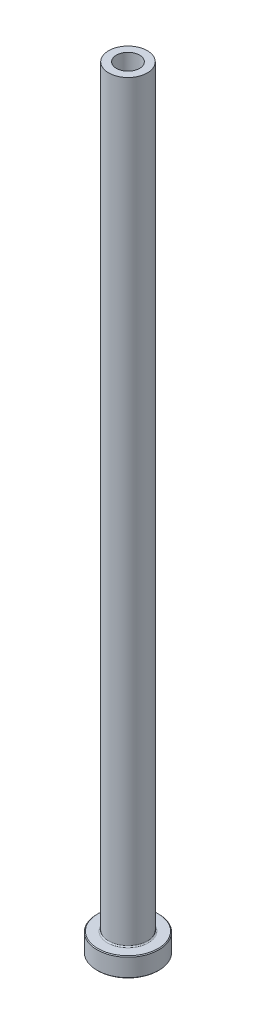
ISO-10303-21;
HEADER;
FILE_DESCRIPTION(('STEP AP214'),'2;1');
FILE_NAME('part.step','',(''),(''),'','','');
FILE_SCHEMA(('AUTOMOTIVE_DESIGN { 1 0 10303 214 1 1 1 1 }'));
ENDSEC;
DATA;
#1=APPLICATION_CONTEXT('core data for automotive mechanical design processes');
#2=APPLICATION_PROTOCOL_DEFINITION('international standard','automotive_design',2000,#1);
#3=PRODUCT_CONTEXT('',#1,'mechanical');
#4=PRODUCT('Part','Part','',(#3));
#5=PRODUCT_RELATED_PRODUCT_CATEGORY('part','',(#4));
#6=PRODUCT_DEFINITION_FORMATION('','',#4);
#7=PRODUCT_DEFINITION_CONTEXT('part definition',#1,'design');
#8=PRODUCT_DEFINITION('design','',#6,#7);
#9=PRODUCT_DEFINITION_SHAPE('','',#8);
#10=(LENGTH_UNIT() NAMED_UNIT(*) SI_UNIT(.MILLI.,.METRE.));
#11=(NAMED_UNIT(*) PLANE_ANGLE_UNIT() SI_UNIT($,.RADIAN.));
#12=(NAMED_UNIT(*) SI_UNIT($,.STERADIAN.) SOLID_ANGLE_UNIT());
#13=UNCERTAINTY_MEASURE_WITH_UNIT(LENGTH_MEASURE(1.E-05),#10,'distance_accuracy_value','');
#14=(GEOMETRIC_REPRESENTATION_CONTEXT(3) GLOBAL_UNCERTAINTY_ASSIGNED_CONTEXT((#13)) GLOBAL_UNIT_ASSIGNED_CONTEXT((#10,
#11,#12)) REPRESENTATION_CONTEXT('',''));
#15=CARTESIAN_POINT('',(0.,0.,0.));
#16=DIRECTION('',(0.,0.,1.));
#17=DIRECTION('',(1.,0.,0.));
#18=AXIS2_PLACEMENT_3D('',#15,#16,#17);
#19=CARTESIAN_POINT('',(0.,92.1876809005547,0.));
#20=DIRECTION('',(0.,1.,0.));
#21=DIRECTION('',(0.,0.,1.));
#22=AXIS2_PLACEMENT_3D('',#19,#20,#21);
#23=CYLINDRICAL_SURFACE('',#22,3.);
#24=CARTESIAN_POINT('',(0.,200.,0.));
#25=DIRECTION('',(0.,1.,0.));
#26=DIRECTION('',(0.,0.,1.));
#27=AXIS2_PLACEMENT_3D('',#24,#25,#26);
#28=CIRCLE('',#27,3.);
#29=CARTESIAN_POINT('',(0.,200.,3.));
#30=VERTEX_POINT('',#29);
#31=EDGE_CURVE('E62',#30,#30,#28,.T.);
#32=ORIENTED_EDGE('',*,*,#31,.T.);
#33=EDGE_LOOP('',(#32));
#34=FACE_BOUND('',#33,.T.);
#35=CARTESIAN_POINT('',(0.,155.,0.));
#36=DIRECTION('',(0.,1.,0.));
#37=DIRECTION('',(0.,0.,1.));
#38=AXIS2_PLACEMENT_3D('',#35,#36,#37);
#39=CIRCLE('',#38,3.);
#40=CARTESIAN_POINT('',(0.,155.,3.));
#41=VERTEX_POINT('',#40);
#42=EDGE_CURVE('E71',#41,#41,#39,.T.);
#43=ORIENTED_EDGE('',*,*,#42,.F.);
#44=EDGE_LOOP('',(#43));
#45=FACE_BOUND('',#44,.T.);
#46=ADVANCED_FACE('F30',(#34,#45),#23,.F.);
#47=CARTESIAN_POINT('',(-3.,200.,0.));
#48=DIRECTION('',(0.,1.,0.));
#49=DIRECTION('',(0.,0.,1.));
#50=AXIS2_PLACEMENT_3D('',#47,#48,#49);
#51=PLANE('',#50);
#52=CARTESIAN_POINT('',(0.,200.,0.));
#53=DIRECTION('',(0.,1.,0.));
#54=DIRECTION('',(0.,0.,1.));
#55=AXIS2_PLACEMENT_3D('',#52,#53,#54);
#56=CIRCLE('',#55,5.00000000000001);
#57=CARTESIAN_POINT('',(0.,200.,5.00000000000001));
#58=VERTEX_POINT('',#57);
#59=EDGE_CURVE('E65',#58,#58,#56,.T.);
#60=ORIENTED_EDGE('',*,*,#59,.T.);
#61=EDGE_LOOP('',(#60));
#62=FACE_BOUND('',#61,.T.);
#63=ORIENTED_EDGE('',*,*,#31,.F.);
#64=EDGE_LOOP('',(#63));
#65=FACE_BOUND('',#64,.T.);
#66=ADVANCED_FACE('F79',(#62,#65),#51,.T.);
#67=CARTESIAN_POINT('',(0.,92.1876809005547,0.));
#68=DIRECTION('',(0.,1.,0.));
#69=DIRECTION('',(0.,0.,1.));
#70=AXIS2_PLACEMENT_3D('',#67,#68,#69);
#71=CYLINDRICAL_SURFACE('',#70,5.);
#72=CARTESIAN_POINT('',(0.,5.3,0.));
#73=DIRECTION('',(0.,1.,0.));
#74=DIRECTION('',(0.,0.,1.));
#75=AXIS2_PLACEMENT_3D('',#72,#73,#74);
#76=CIRCLE('',#75,5.);
#77=CARTESIAN_POINT('',(0.,5.3,5.));
#78=VERTEX_POINT('',#77);
#79=EDGE_CURVE('E59',#78,#78,#76,.T.);
#80=ORIENTED_EDGE('',*,*,#79,.T.);
#81=EDGE_LOOP('',(#80));
#82=FACE_BOUND('',#81,.T.);
#83=ORIENTED_EDGE('',*,*,#59,.F.);
#84=EDGE_LOOP('',(#83));
#85=FACE_BOUND('',#84,.T.);
#86=ADVANCED_FACE('F85',(#82,#85),#71,.T.);
#87=CARTESIAN_POINT('',(-4.99999999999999,5.,0.));
#88=DIRECTION('',(0.,1.,0.));
#89=DIRECTION('',(0.,0.,1.));
#90=AXIS2_PLACEMENT_3D('',#87,#88,#89);
#91=PLANE('',#90);
#92=CARTESIAN_POINT('',(0.,5.,0.));
#93=DIRECTION('',(0.,1.,0.));
#94=DIRECTION('',(0.,0.,1.));
#95=AXIS2_PLACEMENT_3D('',#92,#93,#94);
#96=CIRCLE('',#95,7.79999999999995);
#97=CARTESIAN_POINT('',(0.,5.,7.79999999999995));
#98=VERTEX_POINT('',#97);
#99=EDGE_CURVE('E53',#98,#98,#96,.T.);
#100=ORIENTED_EDGE('',*,*,#99,.T.);
#101=EDGE_LOOP('',(#100));
#102=FACE_BOUND('',#101,.T.);
#103=CARTESIAN_POINT('',(0.,5.,0.));
#104=DIRECTION('',(0.,1.,0.));
#105=DIRECTION('',(0.,0.,1.));
#106=AXIS2_PLACEMENT_3D('',#103,#104,#105);
#107=CIRCLE('',#106,5.3);
#108=CARTESIAN_POINT('',(0.,5.,5.3));
#109=VERTEX_POINT('',#108);
#110=EDGE_CURVE('E56',#109,#109,#107,.F.);
#111=ORIENTED_EDGE('',*,*,#110,.T.);
#112=EDGE_LOOP('',(#111));
#113=FACE_BOUND('',#112,.T.);
#114=ADVANCED_FACE('F111',(#102,#113),#91,.T.);
#115=CARTESIAN_POINT('',(0.,92.1876809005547,0.));
#116=DIRECTION('',(0.,1.,0.));
#117=DIRECTION('',(0.,0.,1.));
#118=AXIS2_PLACEMENT_3D('',#115,#116,#117);
#119=CYLINDRICAL_SURFACE('',#118,7.99999999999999);
#120=CARTESIAN_POINT('',(0.,4.79999999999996,0.));
#121=DIRECTION('',(0.,1.,0.));
#122=DIRECTION('',(0.,0.,1.));
#123=AXIS2_PLACEMENT_3D('',#120,#121,#122);
#124=CIRCLE('',#123,7.99999999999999);
#125=CARTESIAN_POINT('',(0.,4.79999999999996,7.99999999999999));
#126=VERTEX_POINT('',#125);
#127=EDGE_CURVE('E45',#126,#126,#124,.F.);
#128=ORIENTED_EDGE('',*,*,#127,.T.);
#129=EDGE_LOOP('',(#128));
#130=FACE_BOUND('',#129,.T.);
#131=CARTESIAN_POINT('',(0.,0.200000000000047,0.));
#132=DIRECTION('',(0.,-1.,0.));
#133=DIRECTION('',(0.,0.,-1.));
#134=AXIS2_PLACEMENT_3D('',#131,#132,#133);
#135=CIRCLE('',#134,7.99999999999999);
#136=CARTESIAN_POINT('',(0.,0.200000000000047,-7.99999999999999));
#137=VERTEX_POINT('',#136);
#138=EDGE_CURVE('E50',#137,#137,#135,.F.);
#139=ORIENTED_EDGE('',*,*,#138,.T.);
#140=EDGE_LOOP('',(#139));
#141=FACE_BOUND('',#140,.T.);
#142=ADVANCED_FACE('F108',(#130,#141),#119,.T.);
#143=CARTESIAN_POINT('',(-7.99999999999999,0.,0.));
#144=DIRECTION('',(0.,-1.,0.));
#145=DIRECTION('',(0.,0.,-1.));
#146=AXIS2_PLACEMENT_3D('',#143,#144,#145);
#147=PLANE('',#146);
#148=CARTESIAN_POINT('',(0.,0.,0.));
#149=DIRECTION('',(0.,-1.,0.));
#150=DIRECTION('',(0.,0.,-1.));
#151=AXIS2_PLACEMENT_3D('',#148,#149,#150);
#152=CIRCLE('',#151,3.74999999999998);
#153=CARTESIAN_POINT('',(0.,0.,-3.74999999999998));
#154=VERTEX_POINT('',#153);
#155=EDGE_CURVE('E37',#154,#154,#152,.F.);
#156=ORIENTED_EDGE('',*,*,#155,.T.);
#157=EDGE_LOOP('',(#156));
#158=FACE_BOUND('',#157,.T.);
#159=CARTESIAN_POINT('',(0.,0.,0.));
#160=DIRECTION('',(0.,-1.,0.));
#161=DIRECTION('',(0.,0.,-1.));
#162=AXIS2_PLACEMENT_3D('',#159,#160,#161);
#163=CIRCLE('',#162,7.79999999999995);
#164=CARTESIAN_POINT('',(0.,0.,-7.79999999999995));
#165=VERTEX_POINT('',#164);
#166=EDGE_CURVE('E41',#165,#165,#163,.T.);
#167=ORIENTED_EDGE('',*,*,#166,.T.);
#168=EDGE_LOOP('',(#167));
#169=FACE_BOUND('',#168,.T.);
#170=ADVANCED_FACE('F110',(#158,#169),#147,.T.);
#171=CARTESIAN_POINT('',(0.,92.1876809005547,0.));
#172=DIRECTION('',(0.,1.,0.));
#173=DIRECTION('',(0.,0.,1.));
#174=AXIS2_PLACEMENT_3D('',#171,#172,#173);
#175=CYLINDRICAL_SURFACE('',#174,3.25);
#176=CARTESIAN_POINT('',(0.,0.499999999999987,0.));
#177=DIRECTION('',(0.,-1.,0.));
#178=DIRECTION('',(0.,0.,-1.));
#179=AXIS2_PLACEMENT_3D('',#176,#177,#178);
#180=CIRCLE('',#179,3.25);
#181=CARTESIAN_POINT('',(0.,0.499999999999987,-3.25));
#182=VERTEX_POINT('',#181);
#183=EDGE_CURVE('E10',#182,#182,#180,.T.);
#184=ORIENTED_EDGE('',*,*,#183,.T.);
#185=EDGE_LOOP('',(#184));
#186=FACE_BOUND('',#185,.T.);
#187=CARTESIAN_POINT('',(0.,143.,0.));
#188=DIRECTION('',(0.,1.,0.));
#189=DIRECTION('',(0.,0.,1.));
#190=AXIS2_PLACEMENT_3D('',#187,#188,#189);
#191=CIRCLE('',#190,3.25000000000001);
#192=CARTESIAN_POINT('',(0.,143.,3.25000000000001));
#193=VERTEX_POINT('',#192);
#194=EDGE_CURVE('E68',#193,#193,#191,.T.);
#195=ORIENTED_EDGE('',*,*,#194,.T.);
#196=EDGE_LOOP('',(#195));
#197=FACE_BOUND('',#196,.T.);
#198=ADVANCED_FACE('F118',(#186,#197),#175,.F.);
#199=CARTESIAN_POINT('',(0.,143.,0.));
#200=DIRECTION('',(0.,-1.,0.));
#201=DIRECTION('',(0.,0.,-1.));
#202=AXIS2_PLACEMENT_3D('',#199,#200,#201);
#203=CONICAL_SURFACE('',#202,3.25000000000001,0.0208303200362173);
#204=ORIENTED_EDGE('',*,*,#42,.T.);
#205=EDGE_LOOP('',(#204));
#206=FACE_BOUND('',#205,.T.);
#207=ORIENTED_EDGE('',*,*,#194,.F.);
#208=EDGE_LOOP('',(#207));
#209=FACE_BOUND('',#208,.T.);
#210=ADVANCED_FACE('F75',(#206,#209),#203,.F.);
#211=CARTESIAN_POINT('',(0.,5.3,0.));
#212=DIRECTION('',(0.,1.,0.));
#213=DIRECTION('',(0.,0.,1.));
#214=AXIS2_PLACEMENT_3D('',#211,#212,#213);
#215=TOROIDAL_SURFACE('',#214,5.3,0.3);
#216=ORIENTED_EDGE('',*,*,#110,.F.);
#217=EDGE_LOOP('',(#216));
#218=FACE_BOUND('',#217,.T.);
#219=ORIENTED_EDGE('',*,*,#79,.F.);
#220=EDGE_LOOP('',(#219));
#221=FACE_BOUND('',#220,.T.);
#222=ADVANCED_FACE('F90',(#218,#221),#215,.F.);
#223=CARTESIAN_POINT('',(0.,5.,0.));
#224=DIRECTION('',(0.,-1.,0.));
#225=DIRECTION('',(0.,0.,-1.));
#226=AXIS2_PLACEMENT_3D('',#223,#224,#225);
#227=CONICAL_SURFACE('',#226,7.79999999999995,0.78539816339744);
#228=ORIENTED_EDGE('',*,*,#127,.F.);
#229=EDGE_LOOP('',(#228));
#230=FACE_BOUND('',#229,.T.);
#231=ORIENTED_EDGE('',*,*,#99,.F.);
#232=EDGE_LOOP('',(#231));
#233=FACE_BOUND('',#232,.T.);
#234=ADVANCED_FACE('F93',(#230,#233),#227,.T.);
#235=CARTESIAN_POINT('',(0.,0.200000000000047,0.));
#236=DIRECTION('',(0.,1.,0.));
#237=DIRECTION('',(0.,0.,1.));
#238=AXIS2_PLACEMENT_3D('',#235,#236,#237);
#239=CONICAL_SURFACE('',#238,7.99999999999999,0.78539816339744);
#240=ORIENTED_EDGE('',*,*,#166,.F.);
#241=EDGE_LOOP('',(#240));
#242=FACE_BOUND('',#241,.T.);
#243=ORIENTED_EDGE('',*,*,#138,.F.);
#244=EDGE_LOOP('',(#243));
#245=FACE_BOUND('',#244,.T.);
#246=ADVANCED_FACE('F96',(#242,#245),#239,.T.);
#247=CARTESIAN_POINT('',(0.,0.,0.));
#248=DIRECTION('',(0.,-1.,0.));
#249=DIRECTION('',(0.,0.,-1.));
#250=AXIS2_PLACEMENT_3D('',#247,#248,#249);
#251=CONICAL_SURFACE('',#250,3.74999999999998,0.785398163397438);
#252=ORIENTED_EDGE('',*,*,#183,.F.);
#253=EDGE_LOOP('',(#252));
#254=FACE_BOUND('',#253,.T.);
#255=ORIENTED_EDGE('',*,*,#155,.F.);
#256=EDGE_LOOP('',(#255));
#257=FACE_BOUND('',#256,.T.);
#258=ADVANCED_FACE('F32',(#254,#257),#251,.F.);
#259=CLOSED_SHELL('',(#46,#66,#86,#114,#142,#170,#198,#210,#222,#234,#246,#258));
#260=MANIFOLD_SOLID_BREP('B2',#259);
#261=ADVANCED_BREP_SHAPE_REPRESENTATION('',(#18,#260),#14);
#262=SHAPE_DEFINITION_REPRESENTATION(#9,#261);
ENDSEC;
END-ISO-10303-21;
